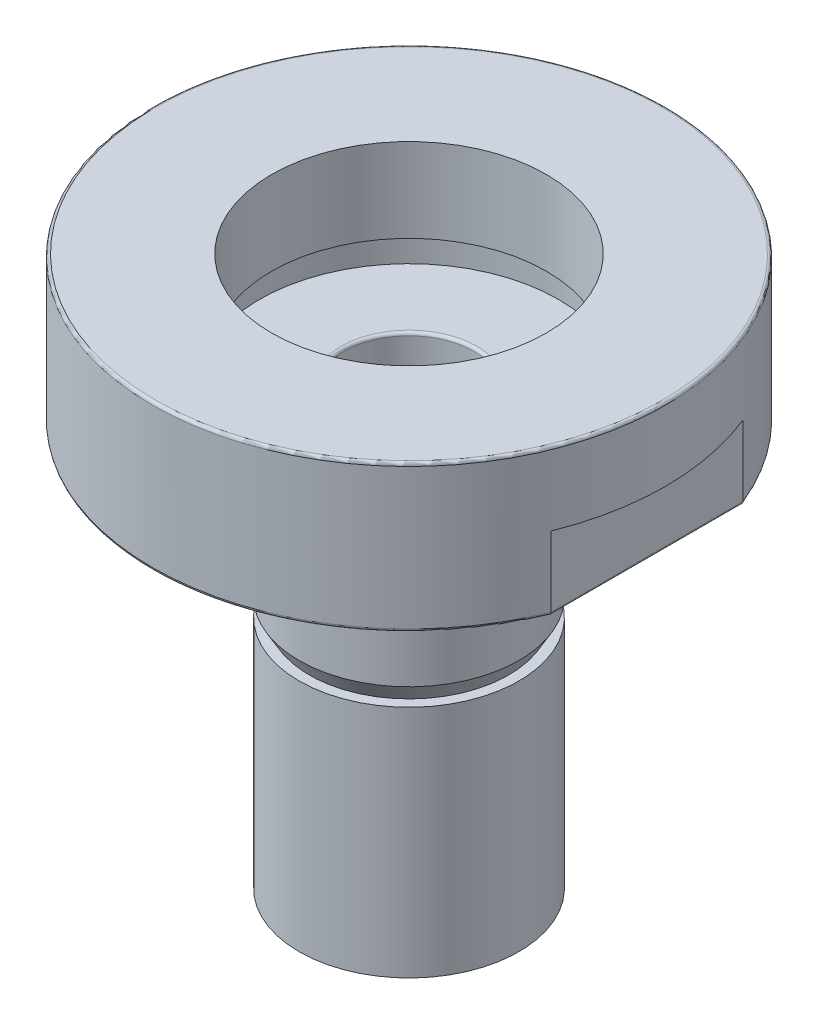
from build123d import *

# Parameters (mm, degrees)
SKETCH2_R          = 5.6515
CUT_EXTRUDE1_DEPTH = 58.061737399
SKETCH6_R          = 11.90625
CUT_EXTRUDE3_DEPTH = 9.906
SKETCH7_W          = 1.04775
SKETCH7_H          = 2.6416
SKETCH8_W          = 0.97409
SKETCH8_H          = 3.175
SKETCH9_W          = 8.532980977
SKETCH9_H          = 34.333887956
CUT_EXTRUDE4_DEPTH = 6.35
SKETCH13_W         = 2.6416
SKETCH13_H         = 1.3208
FILLET4_R          = 0.254
FILLET5_R          = 0.254


with BuildPart() as part:
    # Sketch1 → Revolve1 (revolve)
    with BuildSketch(Plane(origin=(0, 0, 0), x_dir=(0, 0, -1), z_dir=(1, 0, 0))):
        Polygon((0, 12.7), (-22.225, 12.7), (-22.225, 0), (-9.525, 0), (-9.525, -34.925), (0, -34.925), align=None)
    revolve(axis=Axis((0, 38.646019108, 0), (0, -1, 0)))

    # Sketch2 → Cut-Extrude1 (cut, through all)
    with BuildSketch(Plane.XZ.offset(34.925)):
        with Locations(Location((0, 0, 0), (0, 0, 270))):
            Circle(SKETCH2_R)
    extrude(amount=-CUT_EXTRUDE1_DEPTH, mode=Mode.SUBTRACT)

    # Sketch6 → Cut-Extrude3 (cut)
    with BuildSketch(Plane(origin=(0, 12.7, 0), x_dir=(1, 0, 0), z_dir=(0, 1, 0))):
        with Locations(Location((0, 0, 0), (0, 0, 270))):
            Circle(SKETCH6_R)
    extrude(amount=-CUT_EXTRUDE3_DEPTH, mode=Mode.SUBTRACT)

    # Sketch7 → Cut-Revolve1 (revolve, cut)
    with BuildSketch(Plane(origin=(0, 0, 0), x_dir=(0, 0, -1), z_dir=(1, 0, 0))):
        with Locations((-12.430125, 4.1148)):
            Rectangle(SKETCH7_W, SKETCH7_H)
    revolve(axis=Axis((0, 0, 0), (0, 1, 0)), mode=Mode.SUBTRACT)

    # Sketch8 → Cut-Revolve2 (revolve, cut)
    with BuildSketch(Plane.XY, mode=Mode.PRIVATE) as cut_revolve2_sk:
        with Locations((-9.037955, -1.5875)):
            Rectangle(SKETCH8_W, SKETCH8_H)
    revolve(cut_revolve2_sk.sketch.rotate(Axis((0, 0, 0), (0, -1, 0)), 270), axis=Axis((0, 0, 0), (0, -1, 0)), mode=Mode.SUBTRACT)

    # Sketch9 → Cut-Extrude4 (cut)
    with BuildSketch(Plane.XZ):
        with Locations((-24.878590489, 0.378682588)):
            Rectangle(SKETCH9_W, SKETCH9_H)
        with Locations((24.878590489, 0.378682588)):
            Rectangle(SKETCH9_W, SKETCH9_H)
    extrude(amount=-CUT_EXTRUDE4_DEPTH, mode=Mode.SUBTRACT)

    # Sketch13 → Cut-Revolve10 (revolve, cut)
    with BuildSketch(Plane.XY, mode=Mode.PRIVATE) as cut_revolve10_sk:
        with Locations((-16.256, 0.6604)):
            Rectangle(SKETCH13_W, SKETCH13_H)
    revolve(cut_revolve10_sk.sketch.rotate(Axis((0, 0, 0), (0, 1, 0)), 270), axis=Axis((0, 0, 0), (0, 1, 0)), mode=Mode.SUBTRACT)

    # Fillet4
    fillet4_edges = [part.edges().sort_by_distance(p)[0] for p in [
        (0, 1.3208, 17.5768),
        (0, 1.3208, 14.9352),
        (0, 0, 14.9352),
        (0, 0, 17.5768),
    ]]
    fillet(fillet4_edges, radius=FILLET4_R)

    # Fillet5
    fillet5_edges = [part.edges().sort_by_distance(p)[0] for p in [
        (0, -34.925, 5.6515),
        (0, 2.794, 5.6515),
        (0, -3.175, -9.525),
        (0, -3.175, -8.55091),
        (0, 0, -8.55091),
        (12.434084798, 0, 18.421296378),
        (-20.6121, 0, 0),
        (0, 0, -22.225),
        (20.6121, 0, 0),
        (0, 12.7, -22.225),
    ]]
    fillet(fillet5_edges, radius=FILLET5_R)

    # Sketch15 → Cut-Revolve11 (revolve, cut)
    with BuildSketch(Plane.XY, mode=Mode.PRIVATE) as cut_revolve11_sk:
        Polygon((-9.525, -13.069606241), (-8.63854, -14.605), (-11.589190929, -14.605), (-11.589190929, -13.069606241), align=None)
    revolve(cut_revolve11_sk.sketch.rotate(Axis((0, -36.670260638, 0), (0, 1, 0)), 270), axis=Axis((0, -36.670260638, 0), (0, 1, 0)), mode=Mode.SUBTRACT)


solid = part.part
